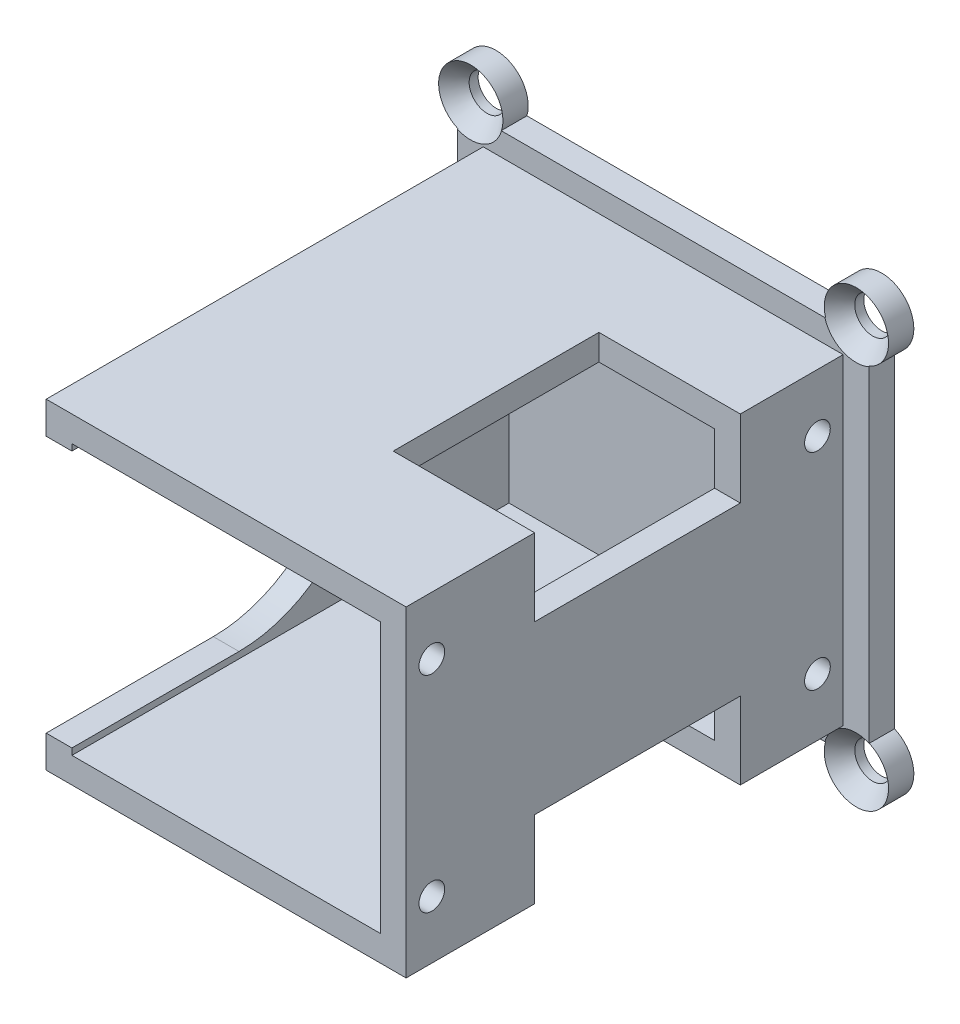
from build123d import *

# Parameters (mm, degrees)
SKIZZE1_W                                  = 28
SKIZZE1_H                                  = 25
SKIZZE1_W_2                                = 24
SKIZZE1_H_2                                = 21
AUFSATZ_LINEAR_AUSTRAGEN1_DEPTH            = 36
SKIZZE2_W                                  = 28
SKIZZE2_H                                  = 25
AUFSATZ_LINEAR_AUSTRAGEN2_DEPTH            = 2
SCHNITT_LINEAR_START                       = -14
SCHNITT_LINEAR_AUSTRAGEN1_DEPTH            = 2
SKIZZE6_R                                  = 2.5
AUFSATZ_LINEAR_AUSTRAGEN3_DEPTH            = 2
SKIZZE10_W                                 = 32
SKIZZE10_H                                 = 28.571428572
AUFSATZ_LINEAR_AUSTRAGEN4_DEPTH            = 2
SPIEGELN6_AT_THE_SECOND_PLANE_COPY_1_SKE_R = 2.5
SPIEGELN6_AT_THE_SECOND_PLANE_COPY_1_DEPTH = 2
SCHNITT_LINEAR_START_2                     = 14
SKIZZE12_W                                 = 16
SKIZZE12_H                                 = 6
SCHNITT_LINEAR_AUSTRAGEN2_DEPTH            = 11
SKETCH1_R                                  = 1
CUT_EXTRUDE1_DEPTH                         = 10


with BuildPart() as part:
    # Skizze1 → Aufsatz-Linear austragen1 (new body)
    with BuildSketch(Plane.XY):
        Rectangle(SKIZZE1_W, SKIZZE1_H)
        Rectangle(SKIZZE1_W_2, SKIZZE1_H_2, mode=Mode.SUBTRACT)
    extrude(amount=AUFSATZ_LINEAR_AUSTRAGEN1_DEPTH)

    # Skizze2 → Aufsatz-Linear austragen2 (add)
    with BuildSketch(Plane.XY):
        Rectangle(SKIZZE2_W, SKIZZE2_H)
    extrude(amount=AUFSATZ_LINEAR_AUSTRAGEN2_DEPTH)

    # Skizze4 → Schnitt-Linear austragen1 (cut)
    with BuildSketch(Plane(origin=(0, 0, 0), x_dir=(0, 0, -1), z_dir=(1, 0, 0)).offset(SCHNITT_LINEAR_START)):
        with BuildLine():
            Line((-23, -10), (-36, -10))
            Line((-36, -10), (-36, 10))
            Line((-36, 10), (-23, 10))
            ThreePointArc((-23, 10), (-13, 0), (-23, -10))
        make_face()
    extrude(amount=SCHNITT_LINEAR_AUSTRAGEN1_DEPTH, mode=Mode.SUBTRACT)



with BuildPart() as body_2:
    # Skizze6 → Aufsatz-Linear austragen3 (new body)
    with BuildSketch(Plane.XY):
        with Locations((-15, -15)):
            Circle(SKIZZE6_R)
    aufsatz_linear_austragen3 = extrude(amount=AUFSATZ_LINEAR_AUSTRAGEN3_DEPTH)


with BuildPart() as part_1:
    add(part.part)

    add(body_2.part)  # Aufsatz-Linear austragen4 merges body 2
    # Skizze10 → Aufsatz-Linear austragen4 (add)
    with BuildSketch(Plane.XY):
        Rectangle(SKIZZE10_W, SKIZZE10_H)
    extrude(amount=AUFSATZ_LINEAR_AUSTRAGEN4_DEPTH)

    # Skizze8 → Formsenkung f_r _3 Linsensenkschraube1 (revolve, cut)
    with BuildSketch(Plane(origin=(-15, -15, 2), x_dir=(0, -1, 0), z_dir=(1, 0, 0))):
        Polygon((0, 0), (0, 2), (1.397, 2), (1.397, 1.300261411), (2.5273, 0), align=None)
    formsenkung_f_r_3_linsensenkschraube1 = revolve(axis=Axis((-15, -15, 8.35), (0, 0, -1)), mode=Mode.SUBTRACT)

    # Spiegeln6: Aufsatz-Linear austragen3, Formsenkung f_r _3 Linsensenkschraube1 across plane
    add(aufsatz_linear_austragen3.mirror(Plane(origin=(0, 0, 0), x_dir=(0, 0, 1), z_dir=(1, 0, 0))))
    add(formsenkung_f_r_3_linsensenkschraube1.mirror(Plane(origin=(0, 0, 0), x_dir=(0, 0, 1), z_dir=(1, 0, 0))), mode=Mode.SUBTRACT)

    # Spiegeln6 at the second plane: Aufsatz-Linear austragen3, Formsenkung f_r _3 Linsensenkschraube1 across plane
    add(aufsatz_linear_austragen3.mirror(Plane.ZX))
    add(formsenkung_f_r_3_linsensenkschraube1.mirror(Plane.ZX), mode=Mode.SUBTRACT)

    # Spiegeln6 at the second plane copy 1 ske → Spiegeln6 at the second plane copy 1 (add)
    with BuildSketch(Plane(origin=(0, 0, 0), x_dir=(-1, 0, 0), z_dir=(0, 0, 1))):
        with Locations((-15, -15)):
            Circle(SPIEGELN6_AT_THE_SECOND_PLANE_COPY_1_SKE_R)
    extrude(amount=SPIEGELN6_AT_THE_SECOND_PLANE_COPY_1_DEPTH)

    # Spiegeln6 at the second plane copy 2 ske → Spiegeln6 at the second plane copy 2 (revolve, cut)
    with BuildSketch(Plane(origin=(15, 15, 2), x_dir=(0, 1, 0), z_dir=(-1, 0, 0))):
        Polygon((0, 0), (0, 2), (1.397, 2), (1.397, 1.300261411), (2.5273, 0), align=None)
    revolve(axis=Axis((15, 15, 8.35), (0, 0, -1)), mode=Mode.SUBTRACT)

    # Skizze12 → Schnitt-Linear austragen2 (cut)
    with BuildSketch(Plane(origin=(0, 0, 0), x_dir=(0, 0, -1), z_dir=(1, 0, 0)).offset(SCHNITT_LINEAR_START_2)):
        with Locations((-18, 9.5)):
            Rectangle(SKIZZE12_W, SKIZZE12_H)
    schnitt_linear_austragen2 = extrude(amount=-SCHNITT_LINEAR_AUSTRAGEN2_DEPTH, mode=Mode.SUBTRACT)

    # Spiegeln7: Schnitt-Linear austragen2 across plane
    add(schnitt_linear_austragen2.mirror(Plane.ZX), mode=Mode.SUBTRACT)

    # Sketch1 → Cut-Extrude1 (cut)
    with BuildSketch(Plane(origin=(14, 0, 0), x_dir=(0, 0, -1), z_dir=(1, 0, 0))):
        with Locations((-34, 8)):
            Circle(SKETCH1_R)
        with Locations((-34, -8)):
            Circle(SKETCH1_R)
        with Locations((-4, 8.017443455)):
            Circle(SKETCH1_R)
        with Locations(Location((-4, -8.017443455, 0), (0, 0, 180))):
            Circle(SKETCH1_R)
    extrude(amount=-CUT_EXTRUDE1_DEPTH, mode=Mode.SUBTRACT)


solid = part_1.part
